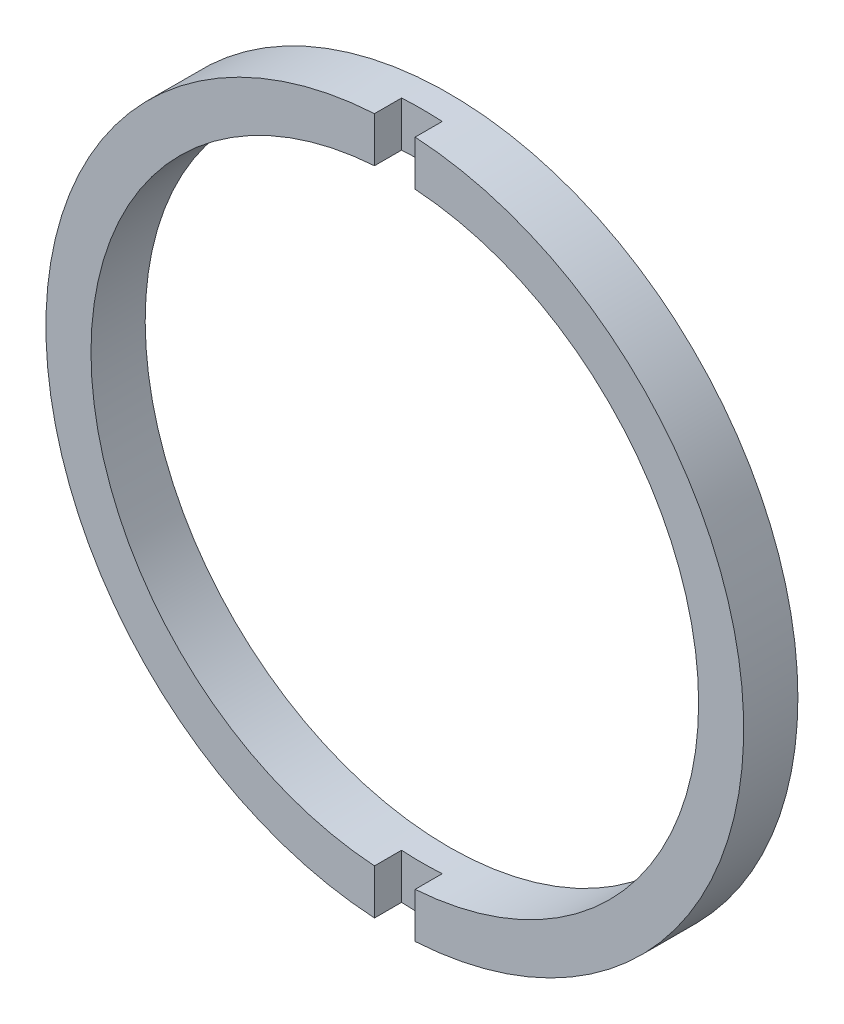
from build123d import *

# Parameters (mm, degrees)
SKETCH_1_R          = 25.75
SKETCH_1_R_2        = 22.423079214
EXTRUDE_1_DEPTH     = 4
SKETCH_2_W          = 3
SKETCH_2_H          = 58.322894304
CUT_EXTRUDE_1_DEPTH = 2


with BuildPart() as part:
    # Sketch 1 → Extrude 1 (new body)
    with BuildSketch(Plane.XY):
        Circle(SKETCH_1_R)
        Circle(SKETCH_1_R_2, mode=Mode.SUBTRACT)
    extrude(amount=EXTRUDE_1_DEPTH)

    # Sketch 2 → Cut-Extrude 1 (cut)
    with BuildSketch(Plane.XY.offset(4)):
        Rectangle(SKETCH_2_W, SKETCH_2_H)
    extrude(amount=-CUT_EXTRUDE_1_DEPTH, mode=Mode.SUBTRACT)


solid = part.part
